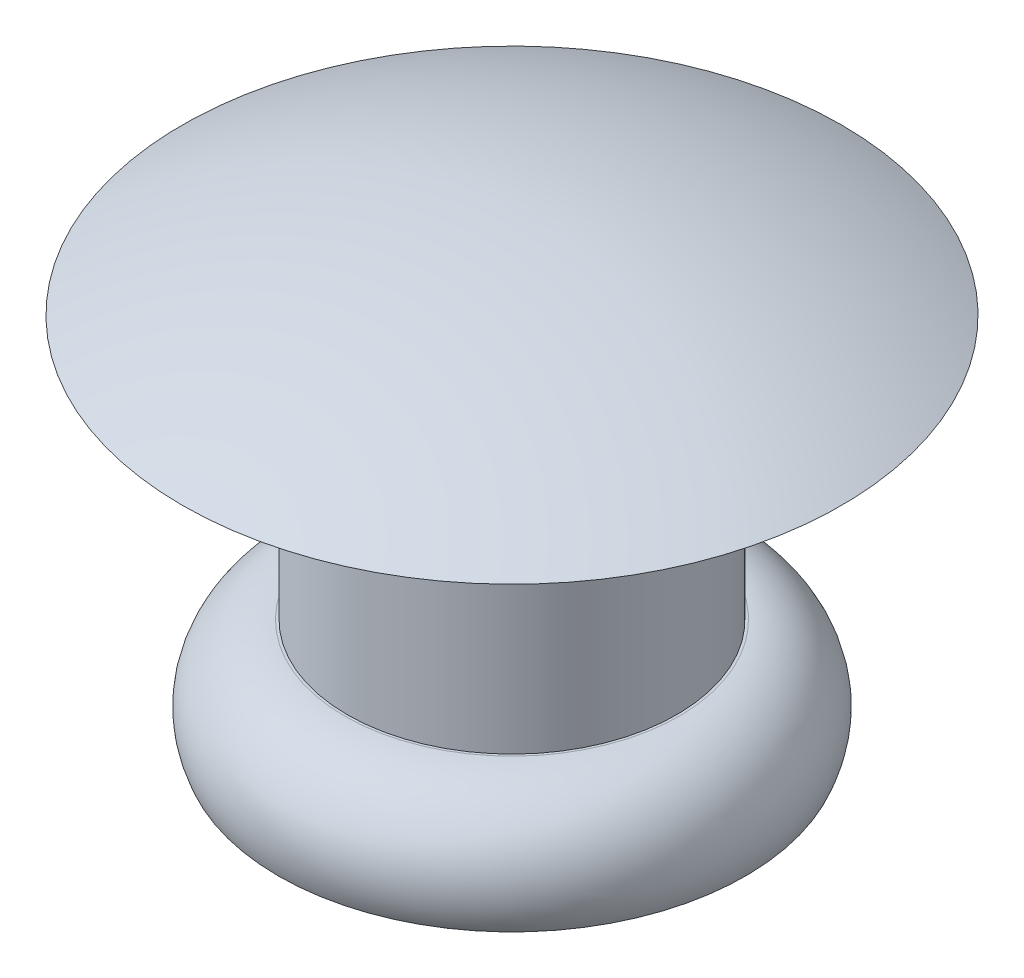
ISO-10303-21;
HEADER;
FILE_DESCRIPTION(('STEP AP214'),'2;1');
FILE_NAME('part.step','',(''),(''),'','','');
FILE_SCHEMA(('AUTOMOTIVE_DESIGN { 1 0 10303 214 1 1 1 1 }'));
ENDSEC;
DATA;
#1=APPLICATION_CONTEXT('core data for automotive mechanical design processes');
#2=APPLICATION_PROTOCOL_DEFINITION('international standard','automotive_design',2000,#1);
#3=PRODUCT_CONTEXT('',#1,'mechanical');
#4=PRODUCT('Part','Part','',(#3));
#5=PRODUCT_RELATED_PRODUCT_CATEGORY('part','',(#4));
#6=PRODUCT_DEFINITION_FORMATION('','',#4);
#7=PRODUCT_DEFINITION_CONTEXT('part definition',#1,'design');
#8=PRODUCT_DEFINITION('design','',#6,#7);
#9=PRODUCT_DEFINITION_SHAPE('','',#8);
#10=(LENGTH_UNIT() NAMED_UNIT(*) SI_UNIT(.MILLI.,.METRE.));
#11=(NAMED_UNIT(*) PLANE_ANGLE_UNIT() SI_UNIT($,.RADIAN.));
#12=(NAMED_UNIT(*) SI_UNIT($,.STERADIAN.) SOLID_ANGLE_UNIT());
#13=UNCERTAINTY_MEASURE_WITH_UNIT(LENGTH_MEASURE(1.E-05),#10,'distance_accuracy_value','');
#14=(GEOMETRIC_REPRESENTATION_CONTEXT(3) GLOBAL_UNCERTAINTY_ASSIGNED_CONTEXT((#13)) GLOBAL_UNIT_ASSIGNED_CONTEXT((#10,
#11,#12)) REPRESENTATION_CONTEXT('',''));
#15=CARTESIAN_POINT('',(0.,0.,0.));
#16=DIRECTION('',(0.,0.,1.));
#17=DIRECTION('',(1.,0.,0.));
#18=AXIS2_PLACEMENT_3D('',#15,#16,#17);
#19=CARTESIAN_POINT('',(0.,3.81,-1.5875));
#20=DIRECTION('',(0.,1.,0.));
#21=DIRECTION('',(0.,0.,1.));
#22=AXIS2_PLACEMENT_3D('',#19,#20,#21);
#23=PLANE('',#22);
#24=CARTESIAN_POINT('',(0.,3.81,0.));
#25=DIRECTION('',(0.,1.,0.));
#26=DIRECTION('',(0.,0.,1.));
#27=AXIS2_PLACEMENT_3D('',#24,#25,#26);
#28=CIRCLE('',#27,3.175);
#29=CARTESIAN_POINT('',(0.,3.81,3.175));
#30=VERTEX_POINT('',#29);
#31=EDGE_CURVE('E52',#30,#30,#28,.T.);
#32=ORIENTED_EDGE('',*,*,#31,.F.);
#33=EDGE_LOOP('',(#32));
#34=FACE_BOUND('',#33,.T.);
#35=CARTESIAN_POINT('',(0.,3.81,0.));
#36=DIRECTION('',(0.,1.,0.));
#37=DIRECTION('',(0.,0.,1.));
#38=AXIS2_PLACEMENT_3D('',#35,#36,#37);
#39=CIRCLE('',#38,1.5875);
#40=CARTESIAN_POINT('',(0.,3.81,1.5875));
#41=VERTEX_POINT('',#40);
#42=EDGE_CURVE('E10',#41,#41,#39,.T.);
#43=ORIENTED_EDGE('',*,*,#42,.T.);
#44=EDGE_LOOP('',(#43));
#45=FACE_BOUND('',#44,.T.);
#46=ADVANCED_FACE('F33',(#34,#45),#23,.F.);
#47=CARTESIAN_POINT('',(0.,4.57336336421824,0.));
#48=DIRECTION('',(0.,1.,0.));
#49=DIRECTION('',(0.,0.,1.));
#50=AXIS2_PLACEMENT_3D('',#47,#48,#49);
#51=CYLINDRICAL_SURFACE('',#50,1.5875);
#52=ORIENTED_EDGE('',*,*,#42,.F.);
#53=EDGE_LOOP('',(#52));
#54=FACE_BOUND('',#53,.T.);
#55=CARTESIAN_POINT('',(0.,1.27,0.));
#56=DIRECTION('',(0.,1.,0.));
#57=DIRECTION('',(0.,0.,1.));
#58=AXIS2_PLACEMENT_3D('',#55,#56,#57);
#59=CIRCLE('',#58,1.5875);
#60=CARTESIAN_POINT('',(0.,1.27,1.5875));
#61=VERTEX_POINT('',#60);
#62=EDGE_CURVE('E39',#61,#61,#59,.T.);
#63=ORIENTED_EDGE('',*,*,#62,.T.);
#64=EDGE_LOOP('',(#63));
#65=FACE_BOUND('',#64,.T.);
#66=ADVANCED_FACE('F59',(#54,#65),#51,.T.);
#67=CARTESIAN_POINT('',(0.,1.27,-1.61170525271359));
#68=DIRECTION('',(0.,-1.,0.));
#69=DIRECTION('',(0.,0.,-1.));
#70=AXIS2_PLACEMENT_3D('',#67,#68,#69);
#71=PLANE('',#70);
#72=ORIENTED_EDGE('',*,*,#62,.F.);
#73=EDGE_LOOP('',(#72));
#74=FACE_BOUND('',#73,.T.);
#75=CARTESIAN_POINT('',(0.,1.27,0.));
#76=DIRECTION('',(0.,1.,0.));
#77=DIRECTION('',(0.,0.,1.));
#78=AXIS2_PLACEMENT_3D('',#75,#76,#77);
#79=CIRCLE('',#78,1.61170525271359);
#80=CARTESIAN_POINT('',(0.,1.27,1.61170525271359));
#81=VERTEX_POINT('',#80);
#82=EDGE_CURVE('E43',#81,#81,#79,.T.);
#83=ORIENTED_EDGE('',*,*,#82,.T.);
#84=EDGE_LOOP('',(#83));
#85=FACE_BOUND('',#84,.T.);
#86=ADVANCED_FACE('F63',(#74,#85),#71,.F.);
#87=CARTESIAN_POINT('',(0.,0.546859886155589,0.));
#88=DIRECTION('',(0.,1.,0.));
#89=DIRECTION('',(0.,0.,1.));
#90=AXIS2_PLACEMENT_3D('',#87,#88,#89);
#91=TOROIDAL_SURFACE('',#90,1.5875,0.723545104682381);
#92=ORIENTED_EDGE('',*,*,#82,.F.);
#93=EDGE_LOOP('',(#92));
#94=FACE_BOUND('',#93,.T.);
#95=CARTESIAN_POINT('',(0.,0.254000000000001,0.));
#96=DIRECTION('',(0.,1.,0.));
#97=DIRECTION('',(0.,0.,1.));
#98=AXIS2_PLACEMENT_3D('',#95,#96,#97);
#99=CIRCLE('',#98,2.2491272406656);
#100=CARTESIAN_POINT('',(0.,0.254000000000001,2.2491272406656));
#101=VERTEX_POINT('',#100);
#102=EDGE_CURVE('E47',#101,#101,#99,.T.);
#103=ORIENTED_EDGE('',*,*,#102,.T.);
#104=EDGE_LOOP('',(#103));
#105=FACE_BOUND('',#104,.T.);
#106=ADVANCED_FACE('F68',(#94,#105),#91,.T.);
#107=CARTESIAN_POINT('',(0.,0.254000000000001,-2.2491272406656));
#108=DIRECTION('',(0.,1.,0.));
#109=DIRECTION('',(0.,0.,1.));
#110=AXIS2_PLACEMENT_3D('',#107,#108,#109);
#111=PLANE('',#110);
#112=ORIENTED_EDGE('',*,*,#102,.F.);
#113=EDGE_LOOP('',(#112));
#114=FACE_BOUND('',#113,.T.);
#115=ADVANCED_FACE('F74',(#114),#111,.F.);
#116=CARTESIAN_POINT('',(0.,-2.41108802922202,0.));
#117=DIRECTION('',(0.,1.,0.));
#118=DIRECTION('',(0.,0.,-1.));
#119=AXIS2_PLACEMENT_3D('',#116,#117,#118);
#120=SPHERICAL_SURFACE('',#119,6.98445139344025);
#121=ORIENTED_EDGE('',*,*,#31,.T.);
#122=EDGE_LOOP('',(#121));
#123=FACE_BOUND('',#122,.T.);
#124=ADVANCED_FACE('F56',(#123),#120,.T.);
#125=CLOSED_SHELL('',(#46,#66,#86,#106,#115,#124));
#126=MANIFOLD_SOLID_BREP('B2',#125);
#127=ADVANCED_BREP_SHAPE_REPRESENTATION('',(#18,#126),#14);
#128=SHAPE_DEFINITION_REPRESENTATION(#9,#127);
ENDSEC;
END-ISO-10303-21;
